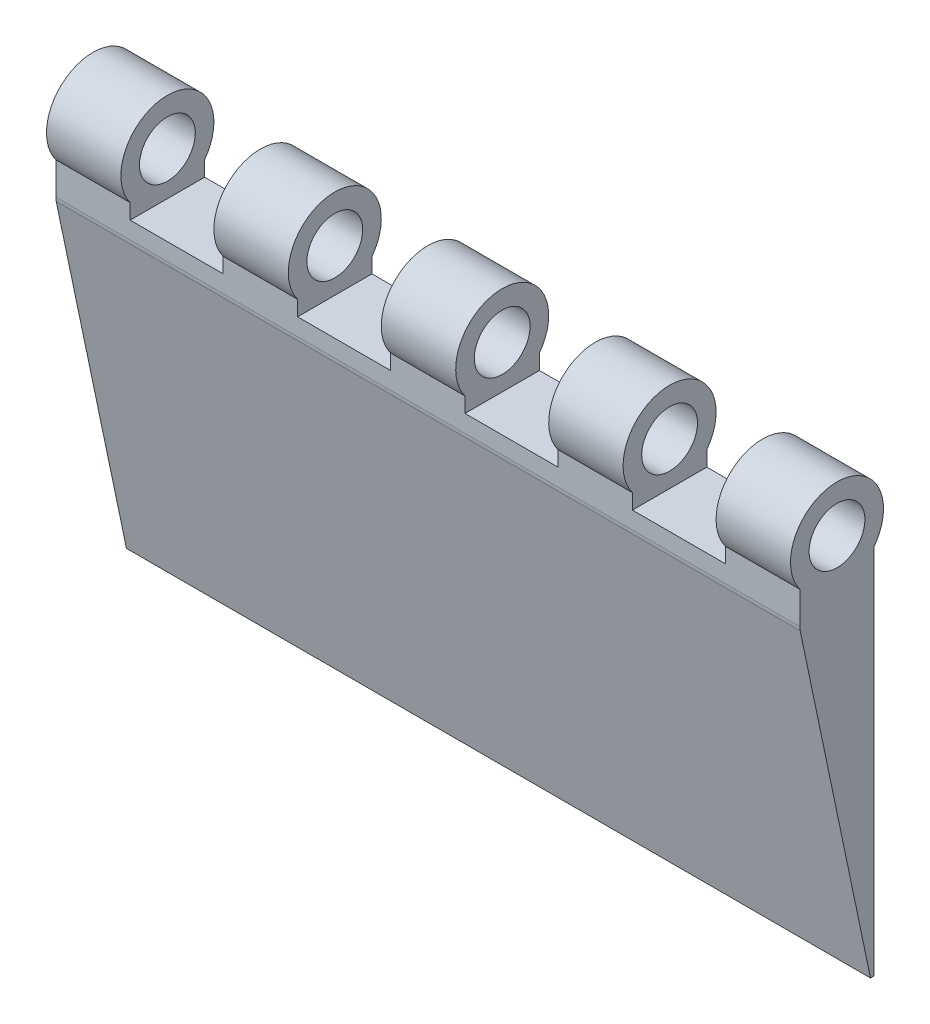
from build123d import *

# Parameters (mm, degrees)
SKETCH1_W               = 4
SKETCH1_H               = 20
BOSS_EXTRUDE1_DEPTH     = 40
SKETCH2_R               = 2.5
SKETCH2_R_2             = 1.5
BOSS_EXTRUDE3_DEPTH     = 40
CUT_EXTRUDE1_DEPTH      = 43.617484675
CUT_EXTRUDE1_DEPTH_BACK = 43.617484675
SKETCH3_W               = 5
SKETCH3_H               = 7.22342783
CUT_EXTRUDE2_DEPTH      = 43.452915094
FILLET1_R               = 1


with BuildPart() as part:
    # Sketch1 → Boss-Extrude1 (new body)
    with BuildSketch(Plane(origin=(0, 0, 0), x_dir=(0, 0, -1), z_dir=(1, 0, 0))):
        Rectangle(SKETCH1_W, SKETCH1_H)
    extrude(amount=BOSS_EXTRUDE1_DEPTH)

    # Sketch2 → Boss-Extrude3 (add)
    with BuildSketch(Plane.ZY):
        with Locations((0, 11.5)):
            Circle(SKETCH2_R)
        with Locations((0, 11.5)):
            Circle(SKETCH2_R_2, mode=Mode.SUBTRACT)
    extrude(amount=-BOSS_EXTRUDE3_DEPTH)

    # Sketch3 → Cut-Extrude1 (cut, two sides: drawn at the far end of the back side and taken through both)
    with BuildSketch(Plane(origin=(0, 0, -2), x_dir=(-1, 0, 0), z_dir=(0, 0, -1)).offset(-CUT_EXTRUDE1_DEPTH_BACK)):
        with Locations((-33.5, 12.796719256)):
            Rectangle(SKETCH3_W, SKETCH3_H)
        with Locations((-24.5, 12.796719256)):
            Rectangle(SKETCH3_W, SKETCH3_H)
        with Locations((-15.5, 12.796719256)):
            Rectangle(SKETCH3_W, SKETCH3_H)
        with Locations((-6.5, 12.796719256)):
            Rectangle(SKETCH3_W, SKETCH3_H)
    extrude(amount=CUT_EXTRUDE1_DEPTH + CUT_EXTRUDE1_DEPTH_BACK, mode=Mode.SUBTRACT)

    # Sketch4 → Cut-Extrude2 (cut, through all)
    with BuildSketch(Plane.ZY):
        Polygon((2, 8.153248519), (-1.8, -10), (5.149137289, -10), (4.693341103, 8.153248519), align=None)
    extrude(amount=-CUT_EXTRUDE2_DEPTH, mode=Mode.SUBTRACT)

    # Fillet1
    fillet1_edges = [part.edges().sort_by_distance(p)[0] for p in [
        (20, 8.153248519, 2),
    ]]
    fillet(fillet1_edges, radius=FILLET1_R)


solid = part.part
